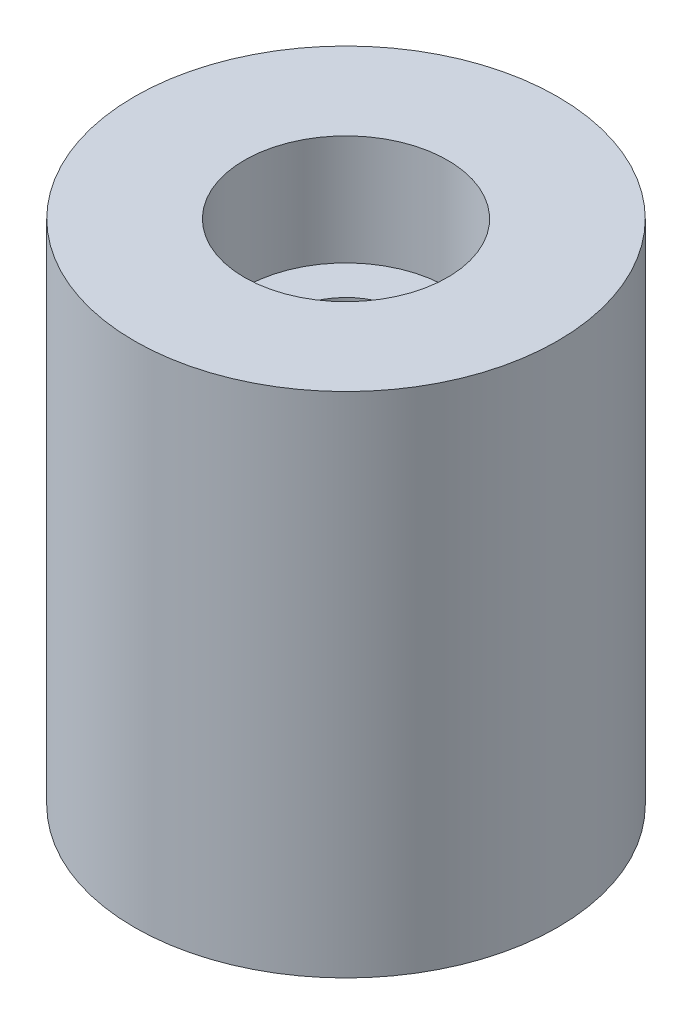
from build123d import *


with BuildPart() as part:
    # Esquisse1 → R_volution1 (revolve)
    with BuildSketch(Plane.XY, mode=Mode.PRIVATE) as r_volution1_sk:
        Polygon((6, 0), (12.5, 0), (12.5, -30), (6, -30), (6, -34), (3.5, -34), (3.5, -6.5), (6, -6.5), align=None)
    revolve(r_volution1_sk.sketch.rotate(Axis((0, 12.578576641, 0), (0, -1, 0)), 90), axis=Axis((0, 12.578576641, 0), (0, -1, 0)))


solid = part.part
